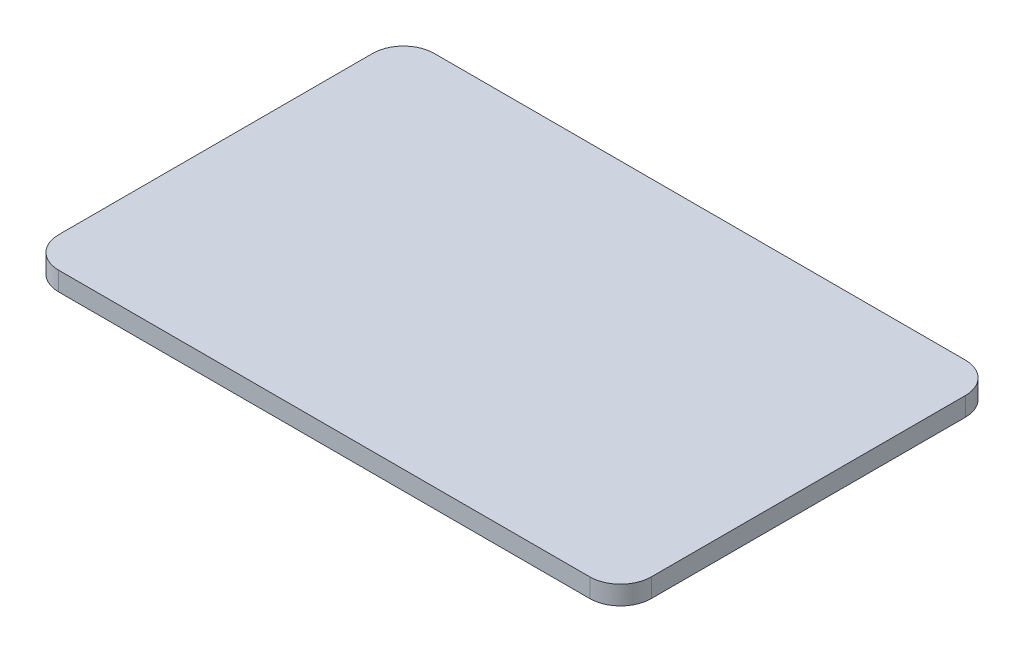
ISO-10303-21;
HEADER;
FILE_DESCRIPTION(('STEP AP214'),'2;1');
FILE_NAME('part.step','',(''),(''),'','','');
FILE_SCHEMA(('AUTOMOTIVE_DESIGN { 1 0 10303 214 1 1 1 1 }'));
ENDSEC;
DATA;
#1=APPLICATION_CONTEXT('core data for automotive mechanical design processes');
#2=APPLICATION_PROTOCOL_DEFINITION('international standard','automotive_design',2000,#1);
#3=PRODUCT_CONTEXT('',#1,'mechanical');
#4=PRODUCT('Part','Part','',(#3));
#5=PRODUCT_RELATED_PRODUCT_CATEGORY('part','',(#4));
#6=PRODUCT_DEFINITION_FORMATION('','',#4);
#7=PRODUCT_DEFINITION_CONTEXT('part definition',#1,'design');
#8=PRODUCT_DEFINITION('design','',#6,#7);
#9=PRODUCT_DEFINITION_SHAPE('','',#8);
#10=(LENGTH_UNIT() NAMED_UNIT(*) SI_UNIT(.MILLI.,.METRE.));
#11=(NAMED_UNIT(*) PLANE_ANGLE_UNIT() SI_UNIT($,.RADIAN.));
#12=(NAMED_UNIT(*) SI_UNIT($,.STERADIAN.) SOLID_ANGLE_UNIT());
#13=UNCERTAINTY_MEASURE_WITH_UNIT(LENGTH_MEASURE(1.E-05),#10,'distance_accuracy_value','');
#14=(GEOMETRIC_REPRESENTATION_CONTEXT(3) GLOBAL_UNCERTAINTY_ASSIGNED_CONTEXT((#13)) GLOBAL_UNIT_ASSIGNED_CONTEXT((#10,
#11,#12)) REPRESENTATION_CONTEXT('',''));
#15=CARTESIAN_POINT('',(0.,0.,0.));
#16=DIRECTION('',(0.,0.,1.));
#17=DIRECTION('',(1.,0.,0.));
#18=AXIS2_PLACEMENT_3D('',#15,#16,#17);
#19=CARTESIAN_POINT('',(3.,1.84,-3.));
#20=DIRECTION('',(0.,-1.,0.));
#21=DIRECTION('',(0.,0.,-1.));
#22=AXIS2_PLACEMENT_3D('',#19,#20,#21);
#23=CYLINDRICAL_SURFACE('',#22,3.);
#24=CARTESIAN_POINT('',(3.,0.,-3.));
#25=DIRECTION('',(0.,1.,0.));
#26=DIRECTION('',(0.,0.,-1.));
#27=AXIS2_PLACEMENT_3D('',#24,#25,#26);
#28=CIRCLE('',#27,3.);
#29=CARTESIAN_POINT('',(0.,0.,-3.00000000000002));
#30=VERTEX_POINT('',#29);
#31=CARTESIAN_POINT('',(3.00000000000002,0.,0.));
#32=VERTEX_POINT('',#31);
#33=EDGE_CURVE('E144',#30,#32,#28,.T.);
#34=ORIENTED_EDGE('',*,*,#33,.T.);
#35=DIRECTION('',(0.,-1.,0.));
#36=VECTOR('',#35,1.);
#37=CARTESIAN_POINT('',(3.00000000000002,1.84,0.));
#38=LINE('',#37,#36);
#39=CARTESIAN_POINT('',(3.00000000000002,1.84,0.));
#40=VERTEX_POINT('',#39);
#41=EDGE_CURVE('E11',#40,#32,#38,.T.);
#42=ORIENTED_EDGE('',*,*,#41,.F.);
#43=CARTESIAN_POINT('',(3.,1.84,-3.));
#44=DIRECTION('',(0.,1.,0.));
#45=DIRECTION('',(0.,0.,-1.));
#46=AXIS2_PLACEMENT_3D('',#43,#44,#45);
#47=CIRCLE('',#46,3.);
#48=CARTESIAN_POINT('',(0.,1.84,-3.00000000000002));
#49=VERTEX_POINT('',#48);
#50=EDGE_CURVE('E166',#49,#40,#47,.T.);
#51=ORIENTED_EDGE('',*,*,#50,.F.);
#52=DIRECTION('',(0.,-1.,0.));
#53=VECTOR('',#52,1.);
#54=CARTESIAN_POINT('',(0.,1.84,-3.00000000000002));
#55=LINE('',#54,#53);
#56=EDGE_CURVE('E140',#49,#30,#55,.T.);
#57=ORIENTED_EDGE('',*,*,#56,.T.);
#58=EDGE_LOOP('',(#34,#42,#51,#57));
#59=FACE_BOUND('',#58,.T.);
#60=ADVANCED_FACE('F43',(#59),#23,.T.);
#61=CARTESIAN_POINT('',(3.00000000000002,1.84,0.));
#62=DIRECTION('',(0.,0.,-1.));
#63=DIRECTION('',(-1.,0.,0.));
#64=AXIS2_PLACEMENT_3D('',#61,#62,#63);
#65=PLANE('',#64);
#66=DIRECTION('',(1.,0.,0.));
#67=VECTOR('',#66,1.);
#68=CARTESIAN_POINT('',(3.00000000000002,0.,0.));
#69=LINE('',#68,#67);
#70=CARTESIAN_POINT('',(54.84,0.,0.));
#71=VERTEX_POINT('',#70);
#72=EDGE_CURVE('E148',#32,#71,#69,.T.);
#73=ORIENTED_EDGE('',*,*,#72,.T.);
#74=DIRECTION('',(0.,-1.,0.));
#75=VECTOR('',#74,1.);
#76=CARTESIAN_POINT('',(54.84,1.84,0.));
#77=LINE('',#76,#75);
#78=CARTESIAN_POINT('',(54.84,1.84,0.));
#79=VERTEX_POINT('',#78);
#80=EDGE_CURVE('E52',#79,#71,#77,.T.);
#81=ORIENTED_EDGE('',*,*,#80,.F.);
#82=DIRECTION('',(1.,0.,0.));
#83=VECTOR('',#82,1.);
#84=CARTESIAN_POINT('',(3.00000000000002,1.84,0.));
#85=LINE('',#84,#83);
#86=EDGE_CURVE('E103',#40,#79,#85,.T.);
#87=ORIENTED_EDGE('',*,*,#86,.F.);
#88=ORIENTED_EDGE('',*,*,#41,.T.);
#89=EDGE_LOOP('',(#73,#81,#87,#88));
#90=FACE_BOUND('',#89,.T.);
#91=ADVANCED_FACE('F212',(#90),#65,.F.);
#92=CARTESIAN_POINT('',(54.84,1.84,-3.));
#93=DIRECTION('',(0.,-1.,0.));
#94=DIRECTION('',(0.,0.,-1.));
#95=AXIS2_PLACEMENT_3D('',#92,#93,#94);
#96=CYLINDRICAL_SURFACE('',#95,3.);
#97=CARTESIAN_POINT('',(54.84,0.,-3.));
#98=DIRECTION('',(0.,1.,0.));
#99=DIRECTION('',(0.,0.,1.));
#100=AXIS2_PLACEMENT_3D('',#97,#98,#99);
#101=CIRCLE('',#100,3.);
#102=CARTESIAN_POINT('',(57.84,0.,-3.00000000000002));
#103=VERTEX_POINT('',#102);
#104=EDGE_CURVE('E151',#71,#103,#101,.T.);
#105=ORIENTED_EDGE('',*,*,#104,.T.);
#106=DIRECTION('',(0.,-1.,0.));
#107=VECTOR('',#106,1.);
#108=CARTESIAN_POINT('',(57.84,1.84,-3.00000000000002));
#109=LINE('',#108,#107);
#110=CARTESIAN_POINT('',(57.84,1.84,-3.00000000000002));
#111=VERTEX_POINT('',#110);
#112=EDGE_CURVE('E177',#111,#103,#109,.T.);
#113=ORIENTED_EDGE('',*,*,#112,.F.);
#114=CARTESIAN_POINT('',(54.84,1.84,-3.));
#115=DIRECTION('',(0.,1.,0.));
#116=DIRECTION('',(0.,0.,1.));
#117=AXIS2_PLACEMENT_3D('',#114,#115,#116);
#118=CIRCLE('',#117,3.);
#119=EDGE_CURVE('E187',#79,#111,#118,.T.);
#120=ORIENTED_EDGE('',*,*,#119,.F.);
#121=ORIENTED_EDGE('',*,*,#80,.T.);
#122=EDGE_LOOP('',(#105,#113,#120,#121));
#123=FACE_BOUND('',#122,.T.);
#124=ADVANCED_FACE('F185',(#123),#96,.T.);
#125=CARTESIAN_POINT('',(57.84,1.84,-3.00000000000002));
#126=DIRECTION('',(-1.,0.,0.));
#127=DIRECTION('',(0.,0.,1.));
#128=AXIS2_PLACEMENT_3D('',#125,#126,#127);
#129=PLANE('',#128);
#130=DIRECTION('',(0.,0.,-1.));
#131=VECTOR('',#130,1.);
#132=CARTESIAN_POINT('',(57.84,0.,-3.00000000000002));
#133=LINE('',#132,#131);
#134=CARTESIAN_POINT('',(57.84,0.,-33.65));
#135=VERTEX_POINT('',#134);
#136=EDGE_CURVE('E154',#103,#135,#133,.T.);
#137=ORIENTED_EDGE('',*,*,#136,.T.);
#138=DIRECTION('',(0.,-1.,0.));
#139=VECTOR('',#138,1.);
#140=CARTESIAN_POINT('',(57.84,1.84,-33.65));
#141=LINE('',#140,#139);
#142=CARTESIAN_POINT('',(57.84,1.84,-33.65));
#143=VERTEX_POINT('',#142);
#144=EDGE_CURVE('E173',#143,#135,#141,.T.);
#145=ORIENTED_EDGE('',*,*,#144,.F.);
#146=DIRECTION('',(0.,0.,-1.));
#147=VECTOR('',#146,1.);
#148=CARTESIAN_POINT('',(57.84,1.84,-3.00000000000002));
#149=LINE('',#148,#147);
#150=EDGE_CURVE('E200',#111,#143,#149,.T.);
#151=ORIENTED_EDGE('',*,*,#150,.F.);
#152=ORIENTED_EDGE('',*,*,#112,.T.);
#153=EDGE_LOOP('',(#137,#145,#151,#152));
#154=FACE_BOUND('',#153,.T.);
#155=ADVANCED_FACE('F195',(#154),#129,.F.);
#156=CARTESIAN_POINT('',(54.84,1.84,-33.65));
#157=DIRECTION('',(0.,-1.,0.));
#158=DIRECTION('',(0.,0.,-1.));
#159=AXIS2_PLACEMENT_3D('',#156,#157,#158);
#160=CYLINDRICAL_SURFACE('',#159,3.);
#161=CARTESIAN_POINT('',(54.84,0.,-33.65));
#162=DIRECTION('',(0.,1.,0.));
#163=DIRECTION('',(0.,0.,-1.));
#164=AXIS2_PLACEMENT_3D('',#161,#162,#163);
#165=CIRCLE('',#164,3.);
#166=CARTESIAN_POINT('',(54.84,0.,-36.65));
#167=VERTEX_POINT('',#166);
#168=EDGE_CURVE('E157',#135,#167,#165,.T.);
#169=ORIENTED_EDGE('',*,*,#168,.T.);
#170=DIRECTION('',(0.,-1.,0.));
#171=VECTOR('',#170,1.);
#172=CARTESIAN_POINT('',(54.84,1.84,-36.65));
#173=LINE('',#172,#171);
#174=CARTESIAN_POINT('',(54.84,1.84,-36.65));
#175=VERTEX_POINT('',#174);
#176=EDGE_CURVE('E133',#175,#167,#173,.T.);
#177=ORIENTED_EDGE('',*,*,#176,.F.);
#178=CARTESIAN_POINT('',(54.84,1.84,-33.65));
#179=DIRECTION('',(0.,1.,0.));
#180=DIRECTION('',(0.,0.,-1.));
#181=AXIS2_PLACEMENT_3D('',#178,#179,#180);
#182=CIRCLE('',#181,3.);
#183=EDGE_CURVE('E122',#143,#175,#182,.T.);
#184=ORIENTED_EDGE('',*,*,#183,.F.);
#185=ORIENTED_EDGE('',*,*,#144,.T.);
#186=EDGE_LOOP('',(#169,#177,#184,#185));
#187=FACE_BOUND('',#186,.T.);
#188=ADVANCED_FACE('F198',(#187),#160,.T.);
#189=CARTESIAN_POINT('',(3.00000000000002,1.84,-36.65));
#190=DIRECTION('',(0.,0.,1.));
#191=DIRECTION('',(1.,0.,0.));
#192=AXIS2_PLACEMENT_3D('',#189,#190,#191);
#193=PLANE('',#192);
#194=DIRECTION('',(-1.,0.,0.));
#195=VECTOR('',#194,1.);
#196=CARTESIAN_POINT('',(3.00000000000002,0.,-36.65));
#197=LINE('',#196,#195);
#198=CARTESIAN_POINT('',(3.00000000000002,0.,-36.65));
#199=VERTEX_POINT('',#198);
#200=EDGE_CURVE('E131',#167,#199,#197,.T.);
#201=ORIENTED_EDGE('',*,*,#200,.T.);
#202=DIRECTION('',(0.,-1.,0.));
#203=VECTOR('',#202,1.);
#204=CARTESIAN_POINT('',(3.00000000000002,1.84,-36.65));
#205=LINE('',#204,#203);
#206=CARTESIAN_POINT('',(3.00000000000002,1.84,-36.65));
#207=VERTEX_POINT('',#206);
#208=EDGE_CURVE('E128',#207,#199,#205,.T.);
#209=ORIENTED_EDGE('',*,*,#208,.F.);
#210=DIRECTION('',(-1.,0.,0.));
#211=VECTOR('',#210,1.);
#212=CARTESIAN_POINT('',(3.00000000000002,1.84,-36.65));
#213=LINE('',#212,#211);
#214=EDGE_CURVE('E116',#175,#207,#213,.T.);
#215=ORIENTED_EDGE('',*,*,#214,.F.);
#216=ORIENTED_EDGE('',*,*,#176,.T.);
#217=EDGE_LOOP('',(#201,#209,#215,#216));
#218=FACE_BOUND('',#217,.T.);
#219=ADVANCED_FACE('F129',(#218),#193,.F.);
#220=CARTESIAN_POINT('',(3.,1.84,-33.65));
#221=DIRECTION('',(0.,-1.,0.));
#222=DIRECTION('',(0.,0.,-1.));
#223=AXIS2_PLACEMENT_3D('',#220,#221,#222);
#224=CYLINDRICAL_SURFACE('',#223,3.);
#225=CARTESIAN_POINT('',(3.,0.,-33.65));
#226=DIRECTION('',(0.,1.,0.));
#227=DIRECTION('',(0.,0.,-1.));
#228=AXIS2_PLACEMENT_3D('',#225,#226,#227);
#229=CIRCLE('',#228,3.);
#230=CARTESIAN_POINT('',(0.,0.,-33.65));
#231=VERTEX_POINT('',#230);
#232=EDGE_CURVE('E89',#199,#231,#229,.T.);
#233=ORIENTED_EDGE('',*,*,#232,.T.);
#234=DIRECTION('',(0.,-1.,0.));
#235=VECTOR('',#234,1.);
#236=CARTESIAN_POINT('',(0.,1.84,-33.65));
#237=LINE('',#236,#235);
#238=CARTESIAN_POINT('',(0.,1.84,-33.65));
#239=VERTEX_POINT('',#238);
#240=EDGE_CURVE('E134',#239,#231,#237,.T.);
#241=ORIENTED_EDGE('',*,*,#240,.F.);
#242=CARTESIAN_POINT('',(3.,1.84,-33.65));
#243=DIRECTION('',(0.,1.,0.));
#244=DIRECTION('',(0.,0.,-1.));
#245=AXIS2_PLACEMENT_3D('',#242,#243,#244);
#246=CIRCLE('',#245,3.);
#247=EDGE_CURVE('E120',#207,#239,#246,.T.);
#248=ORIENTED_EDGE('',*,*,#247,.F.);
#249=ORIENTED_EDGE('',*,*,#208,.T.);
#250=EDGE_LOOP('',(#233,#241,#248,#249));
#251=FACE_BOUND('',#250,.T.);
#252=ADVANCED_FACE('F136',(#251),#224,.T.);
#253=CARTESIAN_POINT('',(0.,1.84,-3.00000000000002));
#254=DIRECTION('',(1.,0.,0.));
#255=DIRECTION('',(0.,0.,-1.));
#256=AXIS2_PLACEMENT_3D('',#253,#254,#255);
#257=PLANE('',#256);
#258=DIRECTION('',(0.,0.,1.));
#259=VECTOR('',#258,1.);
#260=CARTESIAN_POINT('',(0.,0.,-3.00000000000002));
#261=LINE('',#260,#259);
#262=EDGE_CURVE('E95',#231,#30,#261,.T.);
#263=ORIENTED_EDGE('',*,*,#262,.T.);
#264=ORIENTED_EDGE('',*,*,#56,.F.);
#265=DIRECTION('',(0.,0.,1.));
#266=VECTOR('',#265,1.);
#267=CARTESIAN_POINT('',(0.,1.84,-3.00000000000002));
#268=LINE('',#267,#266);
#269=EDGE_CURVE('E60',#239,#49,#268,.T.);
#270=ORIENTED_EDGE('',*,*,#269,.F.);
#271=ORIENTED_EDGE('',*,*,#240,.T.);
#272=EDGE_LOOP('',(#263,#264,#270,#271));
#273=FACE_BOUND('',#272,.T.);
#274=ADVANCED_FACE('F228',(#273),#257,.F.);
#275=CARTESIAN_POINT('',(3.,1.84,-3.));
#276=DIRECTION('',(0.,-1.,0.));
#277=DIRECTION('',(0.,0.,-1.));
#278=AXIS2_PLACEMENT_3D('',#275,#276,#277);
#279=PLANE('',#278);
#280=ORIENTED_EDGE('',*,*,#50,.T.);
#281=ORIENTED_EDGE('',*,*,#86,.T.);
#282=ORIENTED_EDGE('',*,*,#119,.T.);
#283=ORIENTED_EDGE('',*,*,#150,.T.);
#284=ORIENTED_EDGE('',*,*,#183,.T.);
#285=ORIENTED_EDGE('',*,*,#214,.T.);
#286=ORIENTED_EDGE('',*,*,#247,.T.);
#287=ORIENTED_EDGE('',*,*,#269,.T.);
#288=EDGE_LOOP('',(#280,#281,#282,#283,#284,#285,#286,#287));
#289=FACE_BOUND('',#288,.T.);
#290=ADVANCED_FACE('F118',(#289),#279,.F.);
#291=CARTESIAN_POINT('',(3.,0.,-3.));
#292=DIRECTION('',(0.,-1.,0.));
#293=DIRECTION('',(0.,0.,-1.));
#294=AXIS2_PLACEMENT_3D('',#291,#292,#293);
#295=PLANE('',#294);
#296=ORIENTED_EDGE('',*,*,#33,.F.);
#297=ORIENTED_EDGE('',*,*,#262,.F.);
#298=ORIENTED_EDGE('',*,*,#232,.F.);
#299=ORIENTED_EDGE('',*,*,#200,.F.);
#300=ORIENTED_EDGE('',*,*,#168,.F.);
#301=ORIENTED_EDGE('',*,*,#136,.F.);
#302=ORIENTED_EDGE('',*,*,#104,.F.);
#303=ORIENTED_EDGE('',*,*,#72,.F.);
#304=EDGE_LOOP('',(#296,#297,#298,#299,#300,#301,#302,#303));
#305=FACE_BOUND('',#304,.T.);
#306=ADVANCED_FACE('F191',(#305),#295,.T.);
#307=CLOSED_SHELL('',(#60,#91,#124,#155,#188,#219,#252,#274,#290,#306));
#308=MANIFOLD_SOLID_BREP('B2',#307);
#309=ADVANCED_BREP_SHAPE_REPRESENTATION('',(#18,#308),#14);
#310=SHAPE_DEFINITION_REPRESENTATION(#9,#309);
ENDSEC;
END-ISO-10303-21;
